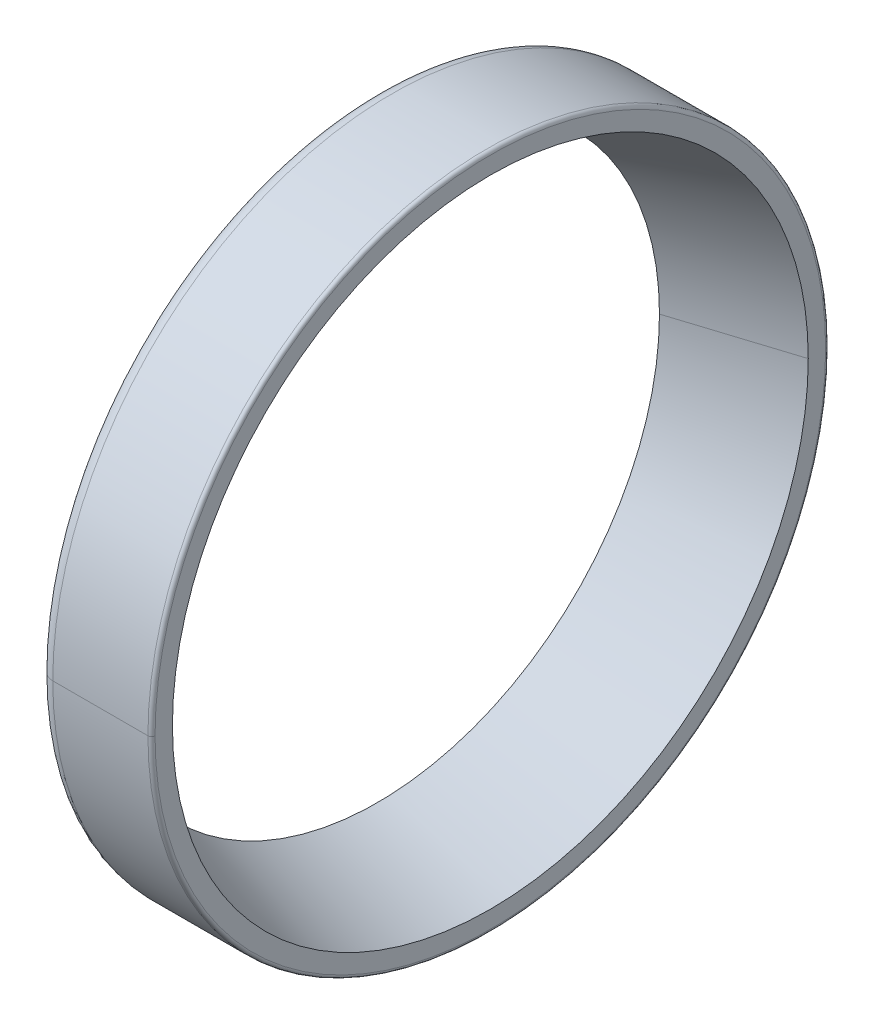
ISO-10303-21;
HEADER;
FILE_DESCRIPTION(('STEP AP214'),'2;1');
FILE_NAME('part.step','',(''),(''),'','','');
FILE_SCHEMA(('AUTOMOTIVE_DESIGN { 1 0 10303 214 1 1 1 1 }'));
ENDSEC;
DATA;
#1=APPLICATION_CONTEXT('core data for automotive mechanical design processes');
#2=APPLICATION_PROTOCOL_DEFINITION('international standard','automotive_design',2000,#1);
#3=PRODUCT_CONTEXT('',#1,'mechanical');
#4=PRODUCT('Part','Part','',(#3));
#5=PRODUCT_RELATED_PRODUCT_CATEGORY('part','',(#4));
#6=PRODUCT_DEFINITION_FORMATION('','',#4);
#7=PRODUCT_DEFINITION_CONTEXT('part definition',#1,'design');
#8=PRODUCT_DEFINITION('design','',#6,#7);
#9=PRODUCT_DEFINITION_SHAPE('','',#8);
#10=(LENGTH_UNIT() NAMED_UNIT(*) SI_UNIT(.MILLI.,.METRE.));
#11=(NAMED_UNIT(*) PLANE_ANGLE_UNIT() SI_UNIT($,.RADIAN.));
#12=(NAMED_UNIT(*) SI_UNIT($,.STERADIAN.) SOLID_ANGLE_UNIT());
#13=UNCERTAINTY_MEASURE_WITH_UNIT(LENGTH_MEASURE(1.E-05),#10,'distance_accuracy_value','');
#14=(GEOMETRIC_REPRESENTATION_CONTEXT(3) GLOBAL_UNCERTAINTY_ASSIGNED_CONTEXT((#13)) GLOBAL_UNIT_ASSIGNED_CONTEXT((#10,
#11,#12)) REPRESENTATION_CONTEXT('',''));
#15=CARTESIAN_POINT('',(0.,0.,0.));
#16=DIRECTION('',(0.,0.,1.));
#17=DIRECTION('',(1.,0.,0.));
#18=AXIS2_PLACEMENT_3D('',#15,#16,#17);
#19=CARTESIAN_POINT('',(25.79878,0.,75.7402083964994));
#20=DIRECTION('',(1.,0.,0.));
#21=DIRECTION('',(0.,1.,0.));
#22=AXIS2_PLACEMENT_3D('',#19,#20,#21);
#23=PLANE('',#22);
#24=CARTESIAN_POINT('',(25.79878,0.,0.));
#25=DIRECTION('',(-1.,0.,0.));
#26=DIRECTION('',(0.,0.,1.));
#27=AXIS2_PLACEMENT_3D('',#24,#25,#26);
#28=CIRCLE('',#27,77.75575);
#29=CARTESIAN_POINT('',(25.79878,0.,77.75575));
#30=VERTEX_POINT('',#29);
#31=CARTESIAN_POINT('',(25.79878,0.,-77.75575));
#32=VERTEX_POINT('',#31);
#33=EDGE_CURVE('E42',#30,#32,#28,.T.);
#34=ORIENTED_EDGE('',*,*,#33,.F.);
#35=CARTESIAN_POINT('',(25.79878,0.,0.));
#36=DIRECTION('',(-1.,0.,0.));
#37=DIRECTION('',(0.,0.,1.));
#38=AXIS2_PLACEMENT_3D('',#35,#36,#37);
#39=CIRCLE('',#38,77.75575);
#40=EDGE_CURVE('E119',#32,#30,#39,.T.);
#41=ORIENTED_EDGE('',*,*,#40,.F.);
#42=EDGE_LOOP('',(#34,#41));
#43=FACE_BOUND('',#42,.T.);
#44=CARTESIAN_POINT('',(25.79878,0.,0.));
#45=DIRECTION('',(-1.,0.,0.));
#46=DIRECTION('',(0.,0.,1.));
#47=AXIS2_PLACEMENT_3D('',#44,#45,#46);
#48=CIRCLE('',#47,73.7246667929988);
#49=CARTESIAN_POINT('',(25.79878,0.,73.7246667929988));
#50=VERTEX_POINT('',#49);
#51=CARTESIAN_POINT('',(25.79878,0.,-73.7246667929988));
#52=VERTEX_POINT('',#51);
#53=EDGE_CURVE('E11',#50,#52,#48,.T.);
#54=ORIENTED_EDGE('',*,*,#53,.T.);
#55=CARTESIAN_POINT('',(25.79878,0.,0.));
#56=DIRECTION('',(-1.,0.,0.));
#57=DIRECTION('',(0.,0.,1.));
#58=AXIS2_PLACEMENT_3D('',#55,#56,#57);
#59=CIRCLE('',#58,73.7246667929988);
#60=EDGE_CURVE('E28',#52,#50,#59,.T.);
#61=ORIENTED_EDGE('',*,*,#60,.T.);
#62=EDGE_LOOP('',(#54,#61));
#63=FACE_BOUND('',#62,.T.);
#64=ADVANCED_FACE('F17',(#43,#63),#23,.T.);
#65=CARTESIAN_POINT('',(24.97328,0.,0.));
#66=DIRECTION('',(-1.,0.,0.));
#67=DIRECTION('',(0.,0.,1.));
#68=AXIS2_PLACEMENT_3D('',#65,#66,#67);
#69=TOROIDAL_SURFACE('',#68,77.75575,0.8255);
#70=CARTESIAN_POINT('',(24.97328,0.,77.75575));
#71=DIRECTION('',(0.,-1.,0.));
#72=DIRECTION('',(0.,0.,1.));
#73=AXIS2_PLACEMENT_3D('',#70,#71,#72);
#74=CIRCLE('',#73,0.8255);
#75=CARTESIAN_POINT('',(24.97328,0.,78.58125));
#76=VERTEX_POINT('',#75);
#77=EDGE_CURVE('E118',#30,#76,#74,.T.);
#78=ORIENTED_EDGE('',*,*,#77,.T.);
#79=CARTESIAN_POINT('',(24.97328,0.,0.));
#80=DIRECTION('',(-1.,0.,0.));
#81=DIRECTION('',(0.,0.,1.));
#82=AXIS2_PLACEMENT_3D('',#79,#80,#81);
#83=CIRCLE('',#82,78.58125);
#84=CARTESIAN_POINT('',(24.97328,0.,-78.58125));
#85=VERTEX_POINT('',#84);
#86=EDGE_CURVE('E98',#85,#76,#83,.T.);
#87=ORIENTED_EDGE('',*,*,#86,.F.);
#88=CARTESIAN_POINT('',(24.97328,0.,-77.75575));
#89=DIRECTION('',(0.,-1.,0.));
#90=DIRECTION('',(0.,0.,-1.));
#91=AXIS2_PLACEMENT_3D('',#88,#89,#90);
#92=CIRCLE('',#91,0.8255);
#93=EDGE_CURVE('E115',#85,#32,#92,.T.);
#94=ORIENTED_EDGE('',*,*,#93,.T.);
#95=ORIENTED_EDGE('',*,*,#40,.T.);
#96=EDGE_LOOP('',(#78,#87,#94,#95));
#97=FACE_BOUND('',#96,.T.);
#98=ADVANCED_FACE('F19',(#97),#69,.T.);
#99=CARTESIAN_POINT('',(12.70127,0.,0.));
#100=DIRECTION('',(1.,0.,0.));
#101=DIRECTION('',(0.,0.,1.));
#102=AXIS2_PLACEMENT_3D('',#99,#100,#101);
#103=CONICAL_SURFACE('',#102,69.5699157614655,0.307176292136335);
#104=DIRECTION('',(-0.953191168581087,0.,-0.302368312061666));
#105=VECTOR('',#104,1.);
#106=CARTESIAN_POINT('',(12.70127,0.,69.5699157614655));
#107=LINE('',#106,#105);
#108=CARTESIAN_POINT('',(-0.39624,0.,65.4151647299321));
#109=VERTEX_POINT('',#108);
#110=EDGE_CURVE('E136',#50,#109,#107,.T.);
#111=ORIENTED_EDGE('',*,*,#110,.F.);
#112=ORIENTED_EDGE('',*,*,#60,.F.);
#113=DIRECTION('',(0.953191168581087,0.,-0.302368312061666));
#114=VECTOR('',#113,1.);
#115=CARTESIAN_POINT('',(12.70127,0.,-69.5699157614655));
#116=LINE('',#115,#114);
#117=CARTESIAN_POINT('',(-0.39624,0.,-65.4151647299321));
#118=VERTEX_POINT('',#117);
#119=EDGE_CURVE('E128',#118,#52,#116,.T.);
#120=ORIENTED_EDGE('',*,*,#119,.F.);
#121=CARTESIAN_POINT('',(-0.39624,0.,0.));
#122=DIRECTION('',(-1.,0.,0.));
#123=DIRECTION('',(0.,0.,1.));
#124=AXIS2_PLACEMENT_3D('',#121,#122,#123);
#125=CIRCLE('',#124,65.4151647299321);
#126=EDGE_CURVE('E143',#118,#109,#125,.T.);
#127=ORIENTED_EDGE('',*,*,#126,.T.);
#128=EDGE_LOOP('',(#111,#112,#120,#127));
#129=FACE_BOUND('',#128,.T.);
#130=ADVANCED_FACE('F256',(#129),#103,.F.);
#131=CARTESIAN_POINT('',(12.70127,0.,0.));
#132=DIRECTION('',(1.,0.,0.));
#133=DIRECTION('',(0.,0.,1.));
#134=AXIS2_PLACEMENT_3D('',#131,#132,#133);
#135=CONICAL_SURFACE('',#134,69.5699157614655,0.307176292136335);
#136=ORIENTED_EDGE('',*,*,#110,.T.);
#137=CARTESIAN_POINT('',(-0.39624,0.,0.));
#138=DIRECTION('',(-1.,0.,0.));
#139=DIRECTION('',(0.,0.,1.));
#140=AXIS2_PLACEMENT_3D('',#137,#138,#139);
#141=CIRCLE('',#140,65.4151647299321);
#142=EDGE_CURVE('E132',#109,#118,#141,.T.);
#143=ORIENTED_EDGE('',*,*,#142,.T.);
#144=ORIENTED_EDGE('',*,*,#119,.T.);
#145=ORIENTED_EDGE('',*,*,#53,.F.);
#146=EDGE_LOOP('',(#136,#143,#144,#145));
#147=FACE_BOUND('',#146,.T.);
#148=ADVANCED_FACE('F260',(#147),#135,.F.);
#149=CARTESIAN_POINT('',(24.97328,0.,0.));
#150=DIRECTION('',(-1.,0.,0.));
#151=DIRECTION('',(0.,0.,1.));
#152=AXIS2_PLACEMENT_3D('',#149,#150,#151);
#153=TOROIDAL_SURFACE('',#152,77.75575,0.8255);
#154=ORIENTED_EDGE('',*,*,#77,.F.);
#155=ORIENTED_EDGE('',*,*,#33,.T.);
#156=ORIENTED_EDGE('',*,*,#93,.F.);
#157=CARTESIAN_POINT('',(24.97328,0.,0.));
#158=DIRECTION('',(-1.,0.,0.));
#159=DIRECTION('',(0.,0.,1.));
#160=AXIS2_PLACEMENT_3D('',#157,#158,#159);
#161=CIRCLE('',#160,78.58125);
#162=EDGE_CURVE('E89',#76,#85,#161,.T.);
#163=ORIENTED_EDGE('',*,*,#162,.F.);
#164=EDGE_LOOP('',(#154,#155,#156,#163));
#165=FACE_BOUND('',#164,.T.);
#166=ADVANCED_FACE('F280',(#165),#153,.T.);
#167=CARTESIAN_POINT('',(13.93952,0.,0.));
#168=DIRECTION('',(-1.,0.,0.));
#169=DIRECTION('',(0.,0.,1.));
#170=AXIS2_PLACEMENT_3D('',#167,#168,#169);
#171=CYLINDRICAL_SURFACE('',#170,78.58125);
#172=DIRECTION('',(-1.,0.,0.));
#173=VECTOR('',#172,1.);
#174=CARTESIAN_POINT('',(13.93952,0.,78.58125));
#175=LINE('',#174,#173);
#176=CARTESIAN_POINT('',(2.90576,0.,78.58125));
#177=VERTEX_POINT('',#176);
#178=EDGE_CURVE('E139',#76,#177,#175,.T.);
#179=ORIENTED_EDGE('',*,*,#178,.T.);
#180=CARTESIAN_POINT('',(2.90576,0.,0.));
#181=DIRECTION('',(-1.,0.,0.));
#182=DIRECTION('',(0.,0.,1.));
#183=AXIS2_PLACEMENT_3D('',#180,#181,#182);
#184=CIRCLE('',#183,78.58125);
#185=CARTESIAN_POINT('',(2.90576,0.,-78.58125));
#186=VERTEX_POINT('',#185);
#187=EDGE_CURVE('E103',#186,#177,#184,.T.);
#188=ORIENTED_EDGE('',*,*,#187,.F.);
#189=DIRECTION('',(1.,0.,0.));
#190=VECTOR('',#189,1.);
#191=CARTESIAN_POINT('',(13.93952,0.,-78.58125));
#192=LINE('',#191,#190);
#193=EDGE_CURVE('E151',#186,#85,#192,.T.);
#194=ORIENTED_EDGE('',*,*,#193,.T.);
#195=ORIENTED_EDGE('',*,*,#86,.T.);
#196=EDGE_LOOP('',(#179,#188,#194,#195));
#197=FACE_BOUND('',#196,.T.);
#198=ADVANCED_FACE('F160',(#197),#171,.T.);
#199=CARTESIAN_POINT('',(-0.39624,0.,70.347207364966));
#200=DIRECTION('',(-1.,0.,0.));
#201=DIRECTION('',(0.,0.,1.));
#202=AXIS2_PLACEMENT_3D('',#199,#200,#201);
#203=PLANE('',#202);
#204=ORIENTED_EDGE('',*,*,#142,.F.);
#205=ORIENTED_EDGE('',*,*,#126,.F.);
#206=EDGE_LOOP('',(#204,#205));
#207=FACE_BOUND('',#206,.T.);
#208=CARTESIAN_POINT('',(-0.39624,0.,0.));
#209=DIRECTION('',(-1.,0.,0.));
#210=DIRECTION('',(0.,0.,1.));
#211=AXIS2_PLACEMENT_3D('',#208,#209,#210);
#212=CIRCLE('',#211,75.27925);
#213=CARTESIAN_POINT('',(-0.39624,0.,75.27925));
#214=VERTEX_POINT('',#213);
#215=CARTESIAN_POINT('',(-0.39624,0.,-75.27925));
#216=VERTEX_POINT('',#215);
#217=EDGE_CURVE('E83',#214,#216,#212,.T.);
#218=ORIENTED_EDGE('',*,*,#217,.T.);
#219=CARTESIAN_POINT('',(-0.39624,0.,0.));
#220=DIRECTION('',(-1.,0.,0.));
#221=DIRECTION('',(0.,0.,1.));
#222=AXIS2_PLACEMENT_3D('',#219,#220,#221);
#223=CIRCLE('',#222,75.27925);
#224=EDGE_CURVE('E80',#216,#214,#223,.T.);
#225=ORIENTED_EDGE('',*,*,#224,.T.);
#226=EDGE_LOOP('',(#218,#225));
#227=FACE_BOUND('',#226,.T.);
#228=ADVANCED_FACE('F82',(#207,#227),#203,.T.);
#229=CARTESIAN_POINT('',(13.93952,0.,0.));
#230=DIRECTION('',(-1.,0.,0.));
#231=DIRECTION('',(0.,0.,1.));
#232=AXIS2_PLACEMENT_3D('',#229,#230,#231);
#233=CYLINDRICAL_SURFACE('',#232,78.58125);
#234=ORIENTED_EDGE('',*,*,#178,.F.);
#235=ORIENTED_EDGE('',*,*,#162,.T.);
#236=ORIENTED_EDGE('',*,*,#193,.F.);
#237=CARTESIAN_POINT('',(2.90576,0.,0.));
#238=DIRECTION('',(-1.,0.,0.));
#239=DIRECTION('',(0.,0.,1.));
#240=AXIS2_PLACEMENT_3D('',#237,#238,#239);
#241=CIRCLE('',#240,78.58125);
#242=EDGE_CURVE('E21',#177,#186,#241,.T.);
#243=ORIENTED_EDGE('',*,*,#242,.F.);
#244=EDGE_LOOP('',(#234,#235,#236,#243));
#245=FACE_BOUND('',#244,.T.);
#246=ADVANCED_FACE('F164',(#245),#233,.T.);
#247=CARTESIAN_POINT('',(2.90576,0.,0.));
#248=DIRECTION('',(-1.,0.,0.));
#249=DIRECTION('',(0.,0.,1.));
#250=AXIS2_PLACEMENT_3D('',#247,#248,#249);
#251=TOROIDAL_SURFACE('',#250,75.27925,3.302);
#252=CARTESIAN_POINT('',(2.90576,0.,75.27925));
#253=DIRECTION('',(0.,-1.,0.));
#254=DIRECTION('',(0.,0.,1.));
#255=AXIS2_PLACEMENT_3D('',#252,#253,#254);
#256=CIRCLE('',#255,3.302);
#257=EDGE_CURVE('E95',#177,#214,#256,.T.);
#258=ORIENTED_EDGE('',*,*,#257,.T.);
#259=ORIENTED_EDGE('',*,*,#224,.F.);
#260=CARTESIAN_POINT('',(2.90576,0.,-75.27925));
#261=DIRECTION('',(0.,-1.,0.));
#262=DIRECTION('',(0.,0.,-1.));
#263=AXIS2_PLACEMENT_3D('',#260,#261,#262);
#264=CIRCLE('',#263,3.302);
#265=EDGE_CURVE('E96',#216,#186,#264,.T.);
#266=ORIENTED_EDGE('',*,*,#265,.T.);
#267=ORIENTED_EDGE('',*,*,#187,.T.);
#268=EDGE_LOOP('',(#258,#259,#266,#267));
#269=FACE_BOUND('',#268,.T.);
#270=ADVANCED_FACE('F101',(#269),#251,.T.);
#271=CARTESIAN_POINT('',(2.90576,0.,0.));
#272=DIRECTION('',(-1.,0.,0.));
#273=DIRECTION('',(0.,0.,1.));
#274=AXIS2_PLACEMENT_3D('',#271,#272,#273);
#275=TOROIDAL_SURFACE('',#274,75.27925,3.302);
#276=ORIENTED_EDGE('',*,*,#257,.F.);
#277=ORIENTED_EDGE('',*,*,#242,.T.);
#278=ORIENTED_EDGE('',*,*,#265,.F.);
#279=ORIENTED_EDGE('',*,*,#217,.F.);
#280=EDGE_LOOP('',(#276,#277,#278,#279));
#281=FACE_BOUND('',#280,.T.);
#282=ADVANCED_FACE('F93',(#281),#275,.T.);
#283=CLOSED_SHELL('',(#64,#98,#130,#148,#166,#198,#228,#246,#270,#282));
#284=MANIFOLD_SOLID_BREP('B1',#283);
#285=ADVANCED_BREP_SHAPE_REPRESENTATION('',(#18,#284),#14);
#286=SHAPE_DEFINITION_REPRESENTATION(#9,#285);
ENDSEC;
END-ISO-10303-21;
